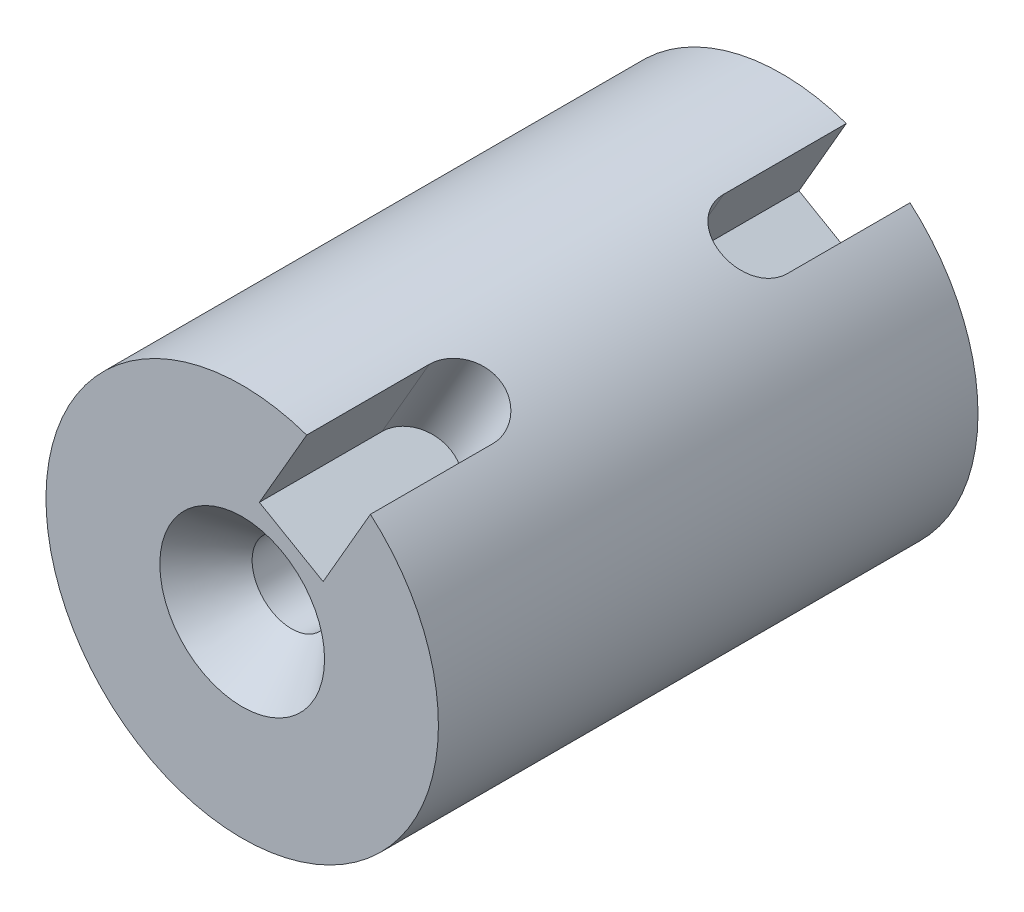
ISO-10303-21;
HEADER;
FILE_DESCRIPTION(('STEP AP214'),'2;1');
FILE_NAME('part.step','',(''),(''),'','','');
FILE_SCHEMA(('AUTOMOTIVE_DESIGN { 1 0 10303 214 1 1 1 1 }'));
ENDSEC;
DATA;
#1=APPLICATION_CONTEXT('core data for automotive mechanical design processes');
#2=APPLICATION_PROTOCOL_DEFINITION('international standard','automotive_design',2000,#1);
#3=PRODUCT_CONTEXT('',#1,'mechanical');
#4=PRODUCT('Part','Part','',(#3));
#5=PRODUCT_RELATED_PRODUCT_CATEGORY('part','',(#4));
#6=PRODUCT_DEFINITION_FORMATION('','',#4);
#7=PRODUCT_DEFINITION_CONTEXT('part definition',#1,'design');
#8=PRODUCT_DEFINITION('design','',#6,#7);
#9=PRODUCT_DEFINITION_SHAPE('','',#8);
#10=(LENGTH_UNIT() NAMED_UNIT(*) SI_UNIT(.MILLI.,.METRE.));
#11=(NAMED_UNIT(*) PLANE_ANGLE_UNIT() SI_UNIT($,.RADIAN.));
#12=(NAMED_UNIT(*) SI_UNIT($,.STERADIAN.) SOLID_ANGLE_UNIT());
#13=UNCERTAINTY_MEASURE_WITH_UNIT(LENGTH_MEASURE(1.E-05),#10,'distance_accuracy_value','');
#14=(GEOMETRIC_REPRESENTATION_CONTEXT(3) GLOBAL_UNCERTAINTY_ASSIGNED_CONTEXT((#13)) GLOBAL_UNIT_ASSIGNED_CONTEXT((#10,
#11,#12)) REPRESENTATION_CONTEXT('',''));
#15=CARTESIAN_POINT('',(0.,0.,0.));
#16=DIRECTION('',(0.,0.,1.));
#17=DIRECTION('',(1.,0.,0.));
#18=AXIS2_PLACEMENT_3D('',#15,#16,#17);
#19=CARTESIAN_POINT('',(0.,0.,23.8125));
#20=DIRECTION('',(0.,0.,1.));
#21=DIRECTION('',(1.,0.,0.));
#22=AXIS2_PLACEMENT_3D('',#19,#20,#21);
#23=CYLINDRICAL_SURFACE('',#22,2.5527);
#24=CARTESIAN_POINT('',(0.,0.,20.6163259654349));
#25=DIRECTION('',(0.,0.,1.));
#26=DIRECTION('',(1.,0.,0.));
#27=AXIS2_PLACEMENT_3D('',#24,#25,#26);
#28=CIRCLE('',#27,2.5527);
#29=CARTESIAN_POINT('',(2.5527,0.,20.6163259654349));
#30=VERTEX_POINT('',#29);
#31=EDGE_CURVE('E173',#30,#30,#28,.T.);
#32=ORIENTED_EDGE('',*,*,#31,.T.);
#33=EDGE_LOOP('',(#32));
#34=FACE_BOUND('',#33,.T.);
#35=CARTESIAN_POINT('',(0.,0.,6.35));
#36=DIRECTION('',(0.,0.,-1.));
#37=DIRECTION('',(-1.,0.,0.));
#38=AXIS2_PLACEMENT_3D('',#35,#36,#37);
#39=CIRCLE('',#38,2.5527);
#40=CARTESIAN_POINT('',(-2.5527,0.,6.35));
#41=VERTEX_POINT('',#40);
#42=EDGE_CURVE('E172',#41,#41,#39,.F.);
#43=ORIENTED_EDGE('',*,*,#42,.F.);
#44=EDGE_LOOP('',(#43));
#45=FACE_BOUND('',#44,.T.);
#46=ADVANCED_FACE('F36',(#34,#45),#23,.F.);
#47=CARTESIAN_POINT('',(0.,0.,12.7));
#48=DIRECTION('',(0.,0.,-1.));
#49=DIRECTION('',(-1.,0.,0.));
#50=AXIS2_PLACEMENT_3D('',#47,#48,#49);
#51=CYLINDRICAL_SURFACE('',#50,12.7);
#52=DIRECTION('',(0.,0.,-1.));
#53=VECTOR('',#52,1.);
#54=CARTESIAN_POINT('',(4.17515723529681,11.9940844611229,12.7));
#55=LINE('',#54,#53);
#56=CARTESIAN_POINT('',(4.17515723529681,11.9940844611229,23.8125));
#57=VERTEX_POINT('',#56);
#58=CARTESIAN_POINT('',(4.17515723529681,11.9940844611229,15.875));
#59=VERTEX_POINT('',#58);
#60=EDGE_CURVE('E152',#57,#59,#55,.T.);
#61=ORIENTED_EDGE('',*,*,#60,.T.);
#62=CARTESIAN_POINT('',(4.17515723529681,11.9940844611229,15.875));
#63=CARTESIAN_POINT('',(4.17514840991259,11.9940833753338,15.8086532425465));
#64=CARTESIAN_POINT('',(4.17782311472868,11.9931563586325,15.7423103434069));
#65=CARTESIAN_POINT('',(4.18847209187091,11.9894436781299,15.6101109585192));
#66=CARTESIAN_POINT('',(4.19644575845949,11.9866582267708,15.5442544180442));
#67=CARTESIAN_POINT('',(4.21761014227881,11.9792271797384,15.4135840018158));
#68=CARTESIAN_POINT('',(4.2307934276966,11.9745842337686,15.3487687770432));
#69=CARTESIAN_POINT('',(4.26223296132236,11.9634295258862,15.2205634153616));
#70=CARTESIAN_POINT('',(4.28048921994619,11.9569177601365,15.1571732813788));
#71=CARTESIAN_POINT('',(4.34263664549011,11.9345496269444,14.9697875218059));
#72=CARTESIAN_POINT('',(4.39392247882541,11.9158550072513,14.8484789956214));
#73=CARTESIAN_POINT('',(4.51425488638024,11.8707877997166,14.6166587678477));
#74=CARTESIAN_POINT('',(4.58330266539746,11.8444146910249,14.5061477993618));
#75=CARTESIAN_POINT('',(4.73763314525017,11.7835381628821,14.2976220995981));
#76=CARTESIAN_POINT('',(4.82308657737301,11.7489482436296,14.1997587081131));
#77=CARTESIAN_POINT('',(5.0068648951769,11.6718129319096,14.0206400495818));
#78=CARTESIAN_POINT('',(5.10519176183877,11.6292663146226,13.9393873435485));
#79=CARTESIAN_POINT('',(5.31232808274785,11.5361234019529,13.7952156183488));
#80=CARTESIAN_POINT('',(5.42121155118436,11.4854683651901,13.7324406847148));
#81=CARTESIAN_POINT('',(5.64531605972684,11.3769892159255,13.627939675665));
#82=CARTESIAN_POINT('',(5.76053622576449,11.3191660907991,13.5862107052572));
#83=CARTESIAN_POINT('',(5.99232193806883,11.1981678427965,13.5254534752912));
#84=CARTESIAN_POINT('',(6.10885635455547,11.1350626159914,13.5061673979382));
#85=CARTESIAN_POINT('',(6.34103422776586,11.0044998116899,13.4900401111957));
#86=CARTESIAN_POINT('',(6.45667773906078,10.9370425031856,13.493197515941));
#87=CARTESIAN_POINT('',(6.68229674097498,10.8006517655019,13.5216706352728));
#88=CARTESIAN_POINT('',(6.79232510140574,10.7317474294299,13.5467081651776));
#89=CARTESIAN_POINT('',(7.00535357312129,10.5939193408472,13.617790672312));
#90=CARTESIAN_POINT('',(7.10835347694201,10.5249955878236,13.663836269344));
#91=CARTESIAN_POINT('',(7.30540321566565,10.3892009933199,13.7758936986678));
#92=CARTESIAN_POINT('',(7.39939909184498,10.3223439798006,13.8420170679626));
#93=CARTESIAN_POINT('',(7.57571111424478,10.1936515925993,13.9922687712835));
#94=CARTESIAN_POINT('',(7.65802647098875,10.1318165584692,14.0763983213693));
#95=CARTESIAN_POINT('',(7.81046043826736,10.0147939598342,14.2617945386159));
#96=CARTESIAN_POINT('',(7.88037438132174,9.95972187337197,14.3633025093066));
#97=CARTESIAN_POINT('',(8.0050628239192,9.85978580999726,14.5798087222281));
#98=CARTESIAN_POINT('',(8.05983308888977,9.81492468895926,14.6948107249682));
#99=CARTESIAN_POINT('',(8.15322254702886,9.73748761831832,14.9353688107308));
#100=CARTESIAN_POINT('',(8.19180499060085,9.70493963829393,15.0609481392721));
#101=CARTESIAN_POINT('',(8.25179953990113,9.6539825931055,15.3187935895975));
#102=CARTESIAN_POINT('',(8.2732372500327,9.63555244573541,15.4510494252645));
#103=CARTESIAN_POINT('',(8.29046934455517,9.62071399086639,15.6327855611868));
#104=CARTESIAN_POINT('',(8.29389642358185,9.61775907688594,15.6811603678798));
#105=CARTESIAN_POINT('',(8.29846034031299,9.61382164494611,15.7780162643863));
#106=CARTESIAN_POINT('',(8.29960102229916,9.61283581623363,15.8264970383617));
#107=CARTESIAN_POINT('',(8.2996032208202,9.61283446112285,15.875));
#108=B_SPLINE_CURVE_WITH_KNOTS('',3,(#62,#63,#64,#65,#66,#67,#68,#69,#70,#71,#72,#73,#74,#75,
#76,#77,#78,#79,#80,#81,#82,#83,#84,#85,#86,#87,#88,#89,#90,#91,#92,#93,#94,#95,#96,#97,#98,#99,
#100,#101,#102,#103,#104,#105,#106,#107),.UNSPECIFIED.,.F.,.F.,(4,2,2,2,2,2,2,2,2,2,2,2,2,2,2,2,
2,2,2,2,2,2,4),(0.,0.198973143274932,0.397923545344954,0.596591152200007,0.795259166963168,
1.19230194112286,1.58937165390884,1.99082267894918,2.39233555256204,2.79690108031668,
3.20141094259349,3.60122654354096,4.00101745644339,4.39579817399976,4.79059053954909,
5.1876174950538,5.58467127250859,5.98776725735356,6.39097584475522,6.79509490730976,
7.19860931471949,7.34429567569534,7.48973687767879),.UNSPECIFIED.);
#109=CARTESIAN_POINT('',(8.2996032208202,9.61283446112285,15.875));
#110=VERTEX_POINT('',#109);
#111=EDGE_CURVE('E48',#59,#110,#108,.T.);
#112=ORIENTED_EDGE('',*,*,#111,.T.);
#113=DIRECTION('',(0.,0.,-1.));
#114=VECTOR('',#113,1.);
#115=CARTESIAN_POINT('',(8.2996032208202,9.61283446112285,12.7));
#116=LINE('',#115,#114);
#117=CARTESIAN_POINT('',(8.2996032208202,9.61283446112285,23.8125));
#118=VERTEX_POINT('',#117);
#119=EDGE_CURVE('E162',#110,#118,#116,.F.);
#120=ORIENTED_EDGE('',*,*,#119,.T.);
#121=CARTESIAN_POINT('',(0.,0.,23.8125));
#122=DIRECTION('',(0.,0.,1.));
#123=DIRECTION('',(1.,0.,0.));
#124=AXIS2_PLACEMENT_3D('',#121,#122,#123);
#125=CIRCLE('',#124,12.7);
#126=EDGE_CURVE('E179',#57,#118,#125,.T.);
#127=ORIENTED_EDGE('',*,*,#126,.F.);
#128=EDGE_LOOP('',(#61,#112,#120,#127));
#129=FACE_BOUND('',#128,.T.);
#130=CARTESIAN_POINT('',(0.,0.,-11.1125));
#131=DIRECTION('',(0.,0.,-1.));
#132=DIRECTION('',(-1.,0.,0.));
#133=AXIS2_PLACEMENT_3D('',#130,#131,#132);
#134=CIRCLE('',#133,12.7);
#135=CARTESIAN_POINT('',(8.2996032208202,9.61283446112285,-11.1125));
#136=VERTEX_POINT('',#135);
#137=CARTESIAN_POINT('',(4.17515723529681,11.9940844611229,-11.1125));
#138=VERTEX_POINT('',#137);
#139=EDGE_CURVE('E127',#136,#138,#134,.T.);
#140=ORIENTED_EDGE('',*,*,#139,.F.);
#141=DIRECTION('',(0.,0.,-1.));
#142=VECTOR('',#141,1.);
#143=CARTESIAN_POINT('',(8.2996032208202,9.61283446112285,12.7));
#144=LINE('',#143,#142);
#145=CARTESIAN_POINT('',(8.2996032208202,9.61283446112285,-3.175));
#146=VERTEX_POINT('',#145);
#147=EDGE_CURVE('E136',#136,#146,#144,.F.);
#148=ORIENTED_EDGE('',*,*,#147,.T.);
#149=CARTESIAN_POINT('',(4.17515723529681,11.9940844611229,-3.175));
#150=CARTESIAN_POINT('',(4.17516291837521,11.994084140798,-3.30748831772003));
#151=CARTESIAN_POINT('',(4.18583223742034,11.9903848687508,-3.44004256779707));
#152=CARTESIAN_POINT('',(4.2281094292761,11.9755406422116,-3.7014133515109));
#153=CARTESIAN_POINT('',(4.25973506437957,11.9643893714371,-3.83022661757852));
#154=CARTESIAN_POINT('',(4.34265680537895,11.9345406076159,-4.08029580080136));
#155=CARTESIAN_POINT('',(4.39393458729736,11.9158501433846,-4.20155863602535));
#156=CARTESIAN_POINT('',(4.51426039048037,11.8707860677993,-4.43333752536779));
#157=CARTESIAN_POINT('',(4.58330702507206,11.8444130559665,-4.54385441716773));
#158=CARTESIAN_POINT('',(4.73763782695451,11.7835362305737,-4.75238794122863));
#159=CARTESIAN_POINT('',(4.82309449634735,11.7489450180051,-4.85025141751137));
#160=CARTESIAN_POINT('',(5.00687328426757,11.6718093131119,-5.02936571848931));
#161=CARTESIAN_POINT('',(5.10519624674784,11.6292642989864,-5.11061545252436));
#162=CARTESIAN_POINT('',(5.31232528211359,11.5361246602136,-5.25478276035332));
#163=CARTESIAN_POINT('',(5.42120552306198,11.4854711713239,-5.31755593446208));
#164=CARTESIAN_POINT('',(5.6453096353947,11.3769924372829,-5.42205789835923));
#165=CARTESIAN_POINT('',(5.76053298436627,11.3191677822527,-5.46378841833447));
#166=CARTESIAN_POINT('',(5.99232330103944,11.1981671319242,-5.52454690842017));
#167=CARTESIAN_POINT('',(6.1088590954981,11.1350611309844,-5.54383306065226));
#168=CARTESIAN_POINT('',(6.34103694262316,11.0044982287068,-5.55995980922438));
#169=CARTESIAN_POINT('',(6.45667907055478,10.9370416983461,-5.55680231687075));
#170=CARTESIAN_POINT('',(6.68229634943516,10.8006520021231,-5.5283294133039));
#171=CARTESIAN_POINT('',(6.79232433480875,10.7317479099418,-5.50329200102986));
#172=CARTESIAN_POINT('',(7.0053528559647,10.5939198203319,-5.43220965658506));
#173=CARTESIAN_POINT('',(7.10835313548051,10.5249958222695,-5.38616395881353));
#174=CARTESIAN_POINT('',(7.30540152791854,10.3892021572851,-5.27410722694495));
#175=CARTESIAN_POINT('',(7.39939587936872,10.322346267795,-5.20798506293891));
#176=CARTESIAN_POINT('',(7.57570828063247,10.1936537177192,-5.05773425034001));
#177=CARTESIAN_POINT('',(7.65802514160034,10.1318175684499,-4.97360377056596));
#178=CARTESIAN_POINT('',(7.81047063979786,10.0147861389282,-4.78819257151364));
#179=CARTESIAN_POINT('',(7.88039301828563,9.95970723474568,-4.68666864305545));
#180=CARTESIAN_POINT('',(8.00507730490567,9.85977390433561,-4.47016261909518));
#181=CARTESIAN_POINT('',(8.05983899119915,9.81491962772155,-4.35518032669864));
#182=CARTESIAN_POINT('',(8.15319049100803,9.73751436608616,-4.11470749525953));
#183=CARTESIAN_POINT('',(8.19175269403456,9.70498439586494,-3.98919944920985));
#184=CARTESIAN_POINT('',(8.2517684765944,9.65400864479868,-3.73141687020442));
#185=CARTESIAN_POINT('',(8.27322399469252,9.63556126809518,-3.59914310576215));
#186=CARTESIAN_POINT('',(8.29838136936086,9.61390354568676,-3.33371931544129));
#187=CARTESIAN_POINT('',(8.30234592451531,9.61046774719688,-3.20061254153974));
#188=CARTESIAN_POINT('',(8.29315530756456,9.61839958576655,-2.93544076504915));
#189=CARTESIAN_POINT('',(8.2800009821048,9.62976649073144,-2.80337571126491));
#190=CARTESIAN_POINT('',(8.23703151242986,9.66654501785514,-2.54515476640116));
#191=CARTESIAN_POINT('',(8.20735489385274,9.69183984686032,-2.41895907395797));
#192=CARTESIAN_POINT('',(8.13203555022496,9.75512186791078,-2.17478421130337));
#193=CARTESIAN_POINT('',(8.08639164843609,9.79310999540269,-2.05680564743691));
#194=CARTESIAN_POINT('',(7.97940332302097,9.88048225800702,-1.83091515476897));
#195=CARTESIAN_POINT('',(7.91788374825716,9.92999287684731,-1.72313514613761));
#196=CARTESIAN_POINT('',(7.78059980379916,10.0379217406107,-1.52207588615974));
#197=CARTESIAN_POINT('',(7.70483415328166,10.0963407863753,-1.42879794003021));
#198=CARTESIAN_POINT('',(7.53945981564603,10.2204380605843,-1.25811952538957));
#199=CARTESIAN_POINT('',(7.44967967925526,10.2862028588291,-1.18094787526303));
#200=CARTESIAN_POINT('',(7.25899261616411,10.4216449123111,-1.04628758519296));
#201=CARTESIAN_POINT('',(7.15808611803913,10.4913220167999,-0.988798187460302));
#202=CARTESIAN_POINT('',(6.94811835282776,10.6315328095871,-0.895476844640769));
#203=CARTESIAN_POINT('',(6.83910279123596,10.702060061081,-0.859532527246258));
#204=CARTESIAN_POINT('',(6.61531962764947,10.84181418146,-0.809963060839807));
#205=CARTESIAN_POINT('',(6.50055263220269,10.9110411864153,-0.796335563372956));
#206=CARTESIAN_POINT('',(6.27031236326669,11.0449377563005,-0.791868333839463));
#207=CARTESIAN_POINT('',(6.15487678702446,11.109660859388,-0.800683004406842));
#208=CARTESIAN_POINT('',(5.92496325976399,11.2339615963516,-0.840092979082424));
#209=CARTESIAN_POINT('',(5.81048529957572,11.2935392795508,-0.870688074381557));
#210=CARTESIAN_POINT('',(5.58613172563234,11.4061770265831,-0.952644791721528));
#211=CARTESIAN_POINT('',(5.47624833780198,11.4592484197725,-1.00396962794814));
#212=CARTESIAN_POINT('',(5.2642053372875,11.5581939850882,-1.12588747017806));
#213=CARTESIAN_POINT('',(5.16204624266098,11.604067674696,-1.19648176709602));
#214=CARTESIAN_POINT('',(4.96722298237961,11.6888047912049,-1.35612418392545));
#215=CARTESIAN_POINT('',(4.87471565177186,11.727558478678,-1.44542197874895));
#216=CARTESIAN_POINT('',(4.70390325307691,11.7971106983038,-1.63941849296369));
#217=CARTESIAN_POINT('',(4.62560153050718,11.8279073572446,-1.7441208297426));
#218=CARTESIAN_POINT('',(4.48526291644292,11.881840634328,-1.96711324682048));
#219=CARTESIAN_POINT('',(4.42338322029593,11.9049037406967,-2.0855200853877));
#220=CARTESIAN_POINT('',(4.319201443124,11.9430985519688,-2.3317609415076));
#221=CARTESIAN_POINT('',(4.27688088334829,11.9582377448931,-2.45958592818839));
#222=CARTESIAN_POINT('',(4.22198216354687,11.9777064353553,-2.68565675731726));
#223=CARTESIAN_POINT('',(4.2044602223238,11.9838503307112,-2.7825790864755));
#224=CARTESIAN_POINT('',(4.18104580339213,11.9920394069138,-2.97798881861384));
#225=CARTESIAN_POINT('',(4.17515300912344,11.9940846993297,-3.07647617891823));
#226=CARTESIAN_POINT('',(4.17515723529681,11.9940844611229,-3.175));
#227=B_SPLINE_CURVE_WITH_KNOTS('',3,(#149,#150,#151,#152,#153,#154,#155,#156,#157,#158,#159,
#160,#161,#162,#163,#164,#165,#166,#167,#168,#169,#170,#171,#172,#173,#174,#175,#176,#177,#178,
#179,#180,#181,#182,#183,#184,#185,#186,#187,#188,#189,#190,#191,#192,#193,#194,#195,#196,#197,
#198,#199,#200,#201,#202,#203,#204,#205,#206,#207,#208,#209,#210,#211,#212,#213,#214,#215,#216,
#217,#218,#219,#220,#221,#222,#223,#224,#225,#226),.UNSPECIFIED.,.T.,.F.,(4,2,2,2,2,2,2,2,2,2,2,
2,2,2,2,2,2,2,2,2,2,2,2,2,2,2,2,2,2,2,2,2,2,2,2,2,2,2,4),(0.,0.397104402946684,
0.794545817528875,1.19161754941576,1.58865830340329,1.99012707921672,2.39162220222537,
2.79617653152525,3.20069759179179,3.60051787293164,4.00030410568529,4.39508345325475,
4.78987718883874,5.18689736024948,5.58395792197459,5.98710725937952,6.39026249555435,
6.79410211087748,7.19789595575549,7.59560407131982,7.99329251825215,8.38769582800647,
8.78212821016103,9.18111356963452,9.58013481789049,9.98448799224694,10.3888255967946,
10.7910355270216,11.1932031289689,11.5892151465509,11.9852233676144,12.3805319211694,
12.7758669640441,13.1768606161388,13.5779485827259,13.9827476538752,14.3871635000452,
14.6824748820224,14.9777782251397),.UNSPECIFIED.);
#228=CARTESIAN_POINT('',(4.17515723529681,11.9940844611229,-3.175));
#229=VERTEX_POINT('',#228);
#230=EDGE_CURVE('E11',#146,#229,#227,.T.);
#231=ORIENTED_EDGE('',*,*,#230,.T.);
#232=DIRECTION('',(0.,0.,-1.));
#233=VECTOR('',#232,1.);
#234=CARTESIAN_POINT('',(4.17515723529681,11.9940844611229,12.7));
#235=LINE('',#234,#233);
#236=EDGE_CURVE('E134',#229,#138,#235,.T.);
#237=ORIENTED_EDGE('',*,*,#236,.T.);
#238=EDGE_LOOP('',(#140,#148,#231,#237));
#239=FACE_BOUND('',#238,.T.);
#240=ADVANCED_FACE('F38',(#129,#239),#51,.T.);
#241=CARTESIAN_POINT('',(0.,0.,23.8125));
#242=DIRECTION('',(0.,0.,1.));
#243=DIRECTION('',(1.,0.,0.));
#244=AXIS2_PLACEMENT_3D('',#241,#242,#243);
#245=PLANE('',#244);
#246=DIRECTION('',(0.500000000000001,0.866025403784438,0.));
#247=VECTOR('',#246,1.);
#248=CARTESIAN_POINT('',(5.2372229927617,4.30863631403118,23.8125));
#249=LINE('',#248,#247);
#250=CARTESIAN_POINT('',(5.2372229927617,4.30863631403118,23.8125));
#251=VERTEX_POINT('',#250);
#252=EDGE_CURVE('E153',#251,#118,#249,.T.);
#253=ORIENTED_EDGE('',*,*,#252,.F.);
#254=DIRECTION('',(0.866025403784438,-0.500000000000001,0.));
#255=VECTOR('',#254,1.);
#256=CARTESIAN_POINT('',(5.2372229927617,4.30863631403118,23.8125));
#257=LINE('',#256,#255);
#258=CARTESIAN_POINT('',(1.11277700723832,6.68988631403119,23.8125));
#259=VERTEX_POINT('',#258);
#260=EDGE_CURVE('E143',#259,#251,#257,.T.);
#261=ORIENTED_EDGE('',*,*,#260,.F.);
#262=DIRECTION('',(0.500000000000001,0.866025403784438,0.));
#263=VECTOR('',#262,1.);
#264=CARTESIAN_POINT('',(1.11277700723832,6.68988631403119,23.8125));
#265=LINE('',#264,#263);
#266=EDGE_CURVE('E155',#259,#57,#265,.T.);
#267=ORIENTED_EDGE('',*,*,#266,.T.);
#268=ORIENTED_EDGE('',*,*,#126,.T.);
#269=EDGE_LOOP('',(#253,#261,#267,#268));
#270=FACE_BOUND('',#269,.T.);
#271=CARTESIAN_POINT('',(0.,0.,23.8125));
#272=DIRECTION('',(0.,0.,1.));
#273=DIRECTION('',(1.,0.,0.));
#274=AXIS2_PLACEMENT_3D('',#271,#272,#273);
#275=CIRCLE('',#274,5.3310917);
#276=CARTESIAN_POINT('',(5.3310917,0.,23.8125));
#277=VERTEX_POINT('',#276);
#278=EDGE_CURVE('E176',#277,#277,#275,.T.);
#279=ORIENTED_EDGE('',*,*,#278,.F.);
#280=EDGE_LOOP('',(#279));
#281=FACE_BOUND('',#280,.T.);
#282=ADVANCED_FACE('F212',(#270,#281),#245,.T.);
#283=CARTESIAN_POINT('',(0.,0.,23.8125));
#284=DIRECTION('',(0.,0.,1.));
#285=DIRECTION('',(1.,0.,0.));
#286=AXIS2_PLACEMENT_3D('',#283,#284,#285);
#287=CONICAL_SURFACE('',#286,5.3310917,0.715584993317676);
#288=ORIENTED_EDGE('',*,*,#31,.F.);
#289=EDGE_LOOP('',(#288));
#290=FACE_BOUND('',#289,.T.);
#291=ORIENTED_EDGE('',*,*,#278,.T.);
#292=EDGE_LOOP('',(#291));
#293=FACE_BOUND('',#292,.T.);
#294=ADVANCED_FACE('F203',(#290,#293),#287,.F.);
#295=CARTESIAN_POINT('',(0.,0.,6.35));
#296=DIRECTION('',(0.,0.,-1.));
#297=DIRECTION('',(-1.,0.,0.));
#298=AXIS2_PLACEMENT_3D('',#295,#296,#297);
#299=PLANE('',#298);
#300=CARTESIAN_POINT('',(0.,0.,6.35));
#301=DIRECTION('',(0.,0.,-1.));
#302=DIRECTION('',(-1.,0.,0.));
#303=AXIS2_PLACEMENT_3D('',#300,#301,#302);
#304=CIRCLE('',#303,4.7625);
#305=CARTESIAN_POINT('',(-4.7625,0.,6.35));
#306=VERTEX_POINT('',#305);
#307=EDGE_CURVE('E169',#306,#306,#304,.T.);
#308=ORIENTED_EDGE('',*,*,#307,.T.);
#309=EDGE_LOOP('',(#308));
#310=FACE_BOUND('',#309,.T.);
#311=ORIENTED_EDGE('',*,*,#42,.T.);
#312=EDGE_LOOP('',(#311));
#313=FACE_BOUND('',#312,.T.);
#314=ADVANCED_FACE('F200',(#310,#313),#299,.T.);
#315=CARTESIAN_POINT('',(0.,0.,6.35));
#316=DIRECTION('',(0.,0.,-1.));
#317=DIRECTION('',(-1.,0.,0.));
#318=AXIS2_PLACEMENT_3D('',#315,#316,#317);
#319=CYLINDRICAL_SURFACE('',#318,4.7625);
#320=ORIENTED_EDGE('',*,*,#307,.F.);
#321=EDGE_LOOP('',(#320));
#322=FACE_BOUND('',#321,.T.);
#323=CARTESIAN_POINT('',(0.,0.,-11.1125));
#324=DIRECTION('',(0.,0.,-1.));
#325=DIRECTION('',(-1.,0.,0.));
#326=AXIS2_PLACEMENT_3D('',#323,#324,#325);
#327=CIRCLE('',#326,4.7625);
#328=CARTESIAN_POINT('',(-4.7625,0.,-11.1125));
#329=VERTEX_POINT('',#328);
#330=EDGE_CURVE('E165',#329,#329,#327,.T.);
#331=ORIENTED_EDGE('',*,*,#330,.T.);
#332=EDGE_LOOP('',(#331));
#333=FACE_BOUND('',#332,.T.);
#334=ADVANCED_FACE('F199',(#322,#333),#319,.F.);
#335=CARTESIAN_POINT('',(0.,0.,-11.1125));
#336=DIRECTION('',(0.,0.,-1.));
#337=DIRECTION('',(-1.,0.,0.));
#338=AXIS2_PLACEMENT_3D('',#335,#336,#337);
#339=PLANE('',#338);
#340=DIRECTION('',(0.500000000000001,0.866025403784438,0.));
#341=VECTOR('',#340,1.);
#342=CARTESIAN_POINT('',(5.2372229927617,4.30863631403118,-11.1125));
#343=LINE('',#342,#341);
#344=CARTESIAN_POINT('',(5.2372229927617,4.30863631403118,-11.1125));
#345=VERTEX_POINT('',#344);
#346=EDGE_CURVE('E137',#345,#136,#343,.T.);
#347=ORIENTED_EDGE('',*,*,#346,.T.);
#348=ORIENTED_EDGE('',*,*,#139,.T.);
#349=DIRECTION('',(0.500000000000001,0.866025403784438,0.));
#350=VECTOR('',#349,1.);
#351=CARTESIAN_POINT('',(1.11277700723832,6.68988631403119,-11.1125));
#352=LINE('',#351,#350);
#353=CARTESIAN_POINT('',(1.11277700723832,6.68988631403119,-11.1125));
#354=VERTEX_POINT('',#353);
#355=EDGE_CURVE('E110',#354,#138,#352,.T.);
#356=ORIENTED_EDGE('',*,*,#355,.F.);
#357=DIRECTION('',(-0.866025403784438,0.500000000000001,0.));
#358=VECTOR('',#357,1.);
#359=CARTESIAN_POINT('',(1.11277700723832,6.68988631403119,-11.1125));
#360=LINE('',#359,#358);
#361=EDGE_CURVE('E116',#345,#354,#360,.T.);
#362=ORIENTED_EDGE('',*,*,#361,.F.);
#363=EDGE_LOOP('',(#347,#348,#356,#362));
#364=FACE_BOUND('',#363,.T.);
#365=ORIENTED_EDGE('',*,*,#330,.F.);
#366=EDGE_LOOP('',(#365));
#367=FACE_BOUND('',#366,.T.);
#368=ADVANCED_FACE('F124',(#364,#367),#339,.T.);
#369=CARTESIAN_POINT('',(3.17500000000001,5.49926131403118,15.875));
#370=DIRECTION('',(0.500000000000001,0.866025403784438,0.));
#371=DIRECTION('',(-0.866025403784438,0.500000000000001,0.));
#372=AXIS2_PLACEMENT_3D('',#369,#370,#371);
#373=CYLINDRICAL_SURFACE('',#372,2.38125);
#374=DIRECTION('',(0.500000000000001,0.866025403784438,0.));
#375=VECTOR('',#374,1.);
#376=CARTESIAN_POINT('',(1.11277700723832,6.68988631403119,15.875));
#377=LINE('',#376,#375);
#378=CARTESIAN_POINT('',(1.11277700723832,6.68988631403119,15.875));
#379=VERTEX_POINT('',#378);
#380=EDGE_CURVE('E148',#379,#59,#377,.T.);
#381=ORIENTED_EDGE('',*,*,#380,.F.);
#382=CARTESIAN_POINT('',(3.17500000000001,5.49926131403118,15.875));
#383=DIRECTION('',(0.500000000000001,0.866025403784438,0.));
#384=DIRECTION('',(-0.866025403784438,0.500000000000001,0.));
#385=AXIS2_PLACEMENT_3D('',#382,#383,#384);
#386=CIRCLE('',#385,2.38125);
#387=CARTESIAN_POINT('',(5.2372229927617,4.30863631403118,15.875));
#388=VERTEX_POINT('',#387);
#389=EDGE_CURVE('E140',#388,#379,#386,.T.);
#390=ORIENTED_EDGE('',*,*,#389,.F.);
#391=DIRECTION('',(0.500000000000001,0.866025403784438,0.));
#392=VECTOR('',#391,1.);
#393=CARTESIAN_POINT('',(5.2372229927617,4.30863631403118,15.875));
#394=LINE('',#393,#392);
#395=EDGE_CURVE('E149',#388,#110,#394,.T.);
#396=ORIENTED_EDGE('',*,*,#395,.T.);
#397=ORIENTED_EDGE('',*,*,#111,.F.);
#398=EDGE_LOOP('',(#381,#390,#396,#397));
#399=FACE_BOUND('',#398,.T.);
#400=ADVANCED_FACE('F188',(#399),#373,.F.);
#401=CARTESIAN_POINT('',(5.2372229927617,4.30863631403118,15.875));
#402=DIRECTION('',(0.866025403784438,-0.500000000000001,0.));
#403=DIRECTION('',(0.500000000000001,0.866025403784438,0.));
#404=AXIS2_PLACEMENT_3D('',#401,#402,#403);
#405=PLANE('',#404);
#406=ORIENTED_EDGE('',*,*,#395,.F.);
#407=DIRECTION('',(0.,0.,-1.));
#408=VECTOR('',#407,1.);
#409=CARTESIAN_POINT('',(5.2372229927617,4.30863631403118,15.875));
#410=LINE('',#409,#408);
#411=EDGE_CURVE('E145',#251,#388,#410,.T.);
#412=ORIENTED_EDGE('',*,*,#411,.F.);
#413=ORIENTED_EDGE('',*,*,#252,.T.);
#414=ORIENTED_EDGE('',*,*,#119,.F.);
#415=EDGE_LOOP('',(#406,#412,#413,#414));
#416=FACE_BOUND('',#415,.T.);
#417=ADVANCED_FACE('F193',(#416),#405,.F.);
#418=CARTESIAN_POINT('',(1.11277700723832,6.68988631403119,23.8125));
#419=DIRECTION('',(-0.866025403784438,0.500000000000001,0.));
#420=DIRECTION('',(-0.500000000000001,-0.866025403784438,0.));
#421=AXIS2_PLACEMENT_3D('',#418,#419,#420);
#422=PLANE('',#421);
#423=ORIENTED_EDGE('',*,*,#266,.F.);
#424=DIRECTION('',(0.,0.,1.));
#425=VECTOR('',#424,1.);
#426=CARTESIAN_POINT('',(1.11277700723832,6.68988631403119,23.8125));
#427=LINE('',#426,#425);
#428=EDGE_CURVE('E63',#379,#259,#427,.T.);
#429=ORIENTED_EDGE('',*,*,#428,.F.);
#430=ORIENTED_EDGE('',*,*,#380,.T.);
#431=ORIENTED_EDGE('',*,*,#60,.F.);
#432=EDGE_LOOP('',(#423,#429,#430,#431));
#433=FACE_BOUND('',#432,.T.);
#434=ADVANCED_FACE('F195',(#433),#422,.F.);
#435=CARTESIAN_POINT('',(3.17500000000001,5.49926131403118,15.875));
#436=DIRECTION('',(0.500000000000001,0.866025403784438,0.));
#437=DIRECTION('',(-0.866025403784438,0.500000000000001,0.));
#438=AXIS2_PLACEMENT_3D('',#435,#436,#437);
#439=PLANE('',#438);
#440=ORIENTED_EDGE('',*,*,#389,.T.);
#441=ORIENTED_EDGE('',*,*,#428,.T.);
#442=ORIENTED_EDGE('',*,*,#260,.T.);
#443=ORIENTED_EDGE('',*,*,#411,.T.);
#444=EDGE_LOOP('',(#440,#441,#442,#443));
#445=FACE_BOUND('',#444,.T.);
#446=ADVANCED_FACE('F231',(#445),#439,.T.);
#447=CARTESIAN_POINT('',(3.17500000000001,5.49926131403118,-3.175));
#448=DIRECTION('',(0.500000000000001,0.866025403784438,0.));
#449=DIRECTION('',(-0.866025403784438,0.500000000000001,0.));
#450=AXIS2_PLACEMENT_3D('',#447,#448,#449);
#451=CYLINDRICAL_SURFACE('',#450,2.38125);
#452=DIRECTION('',(0.500000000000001,0.866025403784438,0.));
#453=VECTOR('',#452,1.);
#454=CARTESIAN_POINT('',(5.2372229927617,4.30863631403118,-3.175));
#455=LINE('',#454,#453);
#456=CARTESIAN_POINT('',(5.2372229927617,4.30863631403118,-3.175));
#457=VERTEX_POINT('',#456);
#458=EDGE_CURVE('E129',#457,#146,#455,.T.);
#459=ORIENTED_EDGE('',*,*,#458,.F.);
#460=CARTESIAN_POINT('',(3.17500000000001,5.49926131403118,-3.175));
#461=DIRECTION('',(0.500000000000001,0.866025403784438,0.));
#462=DIRECTION('',(-0.866025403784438,0.500000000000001,0.));
#463=AXIS2_PLACEMENT_3D('',#460,#461,#462);
#464=CIRCLE('',#463,2.38125);
#465=CARTESIAN_POINT('',(1.11277700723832,6.68988631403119,-3.175));
#466=VERTEX_POINT('',#465);
#467=EDGE_CURVE('E115',#466,#457,#464,.T.);
#468=ORIENTED_EDGE('',*,*,#467,.F.);
#469=DIRECTION('',(0.500000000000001,0.866025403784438,0.));
#470=VECTOR('',#469,1.);
#471=CARTESIAN_POINT('',(1.11277700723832,6.68988631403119,-3.175));
#472=LINE('',#471,#470);
#473=EDGE_CURVE('E113',#466,#229,#472,.T.);
#474=ORIENTED_EDGE('',*,*,#473,.T.);
#475=ORIENTED_EDGE('',*,*,#230,.F.);
#476=EDGE_LOOP('',(#459,#468,#474,#475));
#477=FACE_BOUND('',#476,.T.);
#478=ADVANCED_FACE('F233',(#477),#451,.F.);
#479=CARTESIAN_POINT('',(5.2372229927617,4.30863631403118,-11.1125));
#480=DIRECTION('',(0.866025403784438,-0.500000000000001,0.));
#481=DIRECTION('',(0.500000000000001,0.866025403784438,0.));
#482=AXIS2_PLACEMENT_3D('',#479,#480,#481);
#483=PLANE('',#482);
#484=ORIENTED_EDGE('',*,*,#346,.F.);
#485=DIRECTION('',(0.,0.,-1.));
#486=VECTOR('',#485,1.);
#487=CARTESIAN_POINT('',(5.2372229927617,4.30863631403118,-11.1125));
#488=LINE('',#487,#486);
#489=EDGE_CURVE('E55',#457,#345,#488,.T.);
#490=ORIENTED_EDGE('',*,*,#489,.F.);
#491=ORIENTED_EDGE('',*,*,#458,.T.);
#492=ORIENTED_EDGE('',*,*,#147,.F.);
#493=EDGE_LOOP('',(#484,#490,#491,#492));
#494=FACE_BOUND('',#493,.T.);
#495=ADVANCED_FACE('F239',(#494),#483,.F.);
#496=CARTESIAN_POINT('',(1.11277700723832,6.68988631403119,-3.175));
#497=DIRECTION('',(-0.866025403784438,0.500000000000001,0.));
#498=DIRECTION('',(-0.500000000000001,-0.866025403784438,0.));
#499=AXIS2_PLACEMENT_3D('',#496,#497,#498);
#500=PLANE('',#499);
#501=ORIENTED_EDGE('',*,*,#473,.F.);
#502=DIRECTION('',(0.,0.,1.));
#503=VECTOR('',#502,1.);
#504=CARTESIAN_POINT('',(1.11277700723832,6.68988631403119,-3.175));
#505=LINE('',#504,#503);
#506=EDGE_CURVE('E107',#354,#466,#505,.T.);
#507=ORIENTED_EDGE('',*,*,#506,.F.);
#508=ORIENTED_EDGE('',*,*,#355,.T.);
#509=ORIENTED_EDGE('',*,*,#236,.F.);
#510=EDGE_LOOP('',(#501,#507,#508,#509));
#511=FACE_BOUND('',#510,.T.);
#512=ADVANCED_FACE('F108',(#511),#500,.F.);
#513=CARTESIAN_POINT('',(3.17500000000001,5.49926131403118,-3.175));
#514=DIRECTION('',(0.500000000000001,0.866025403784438,0.));
#515=DIRECTION('',(-0.866025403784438,0.500000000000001,0.));
#516=AXIS2_PLACEMENT_3D('',#513,#514,#515);
#517=PLANE('',#516);
#518=ORIENTED_EDGE('',*,*,#361,.T.);
#519=ORIENTED_EDGE('',*,*,#506,.T.);
#520=ORIENTED_EDGE('',*,*,#467,.T.);
#521=ORIENTED_EDGE('',*,*,#489,.T.);
#522=EDGE_LOOP('',(#518,#519,#520,#521));
#523=FACE_BOUND('',#522,.T.);
#524=ADVANCED_FACE('F119',(#523),#517,.T.);
#525=CLOSED_SHELL('',(#46,#240,#282,#294,#314,#334,#368,#400,#417,#434,#446,#478,#495,#512,#524));
#526=MANIFOLD_SOLID_BREP('B2',#525);
#527=ADVANCED_BREP_SHAPE_REPRESENTATION('',(#18,#526),#14);
#528=SHAPE_DEFINITION_REPRESENTATION(#9,#527);
ENDSEC;
END-ISO-10303-21;
